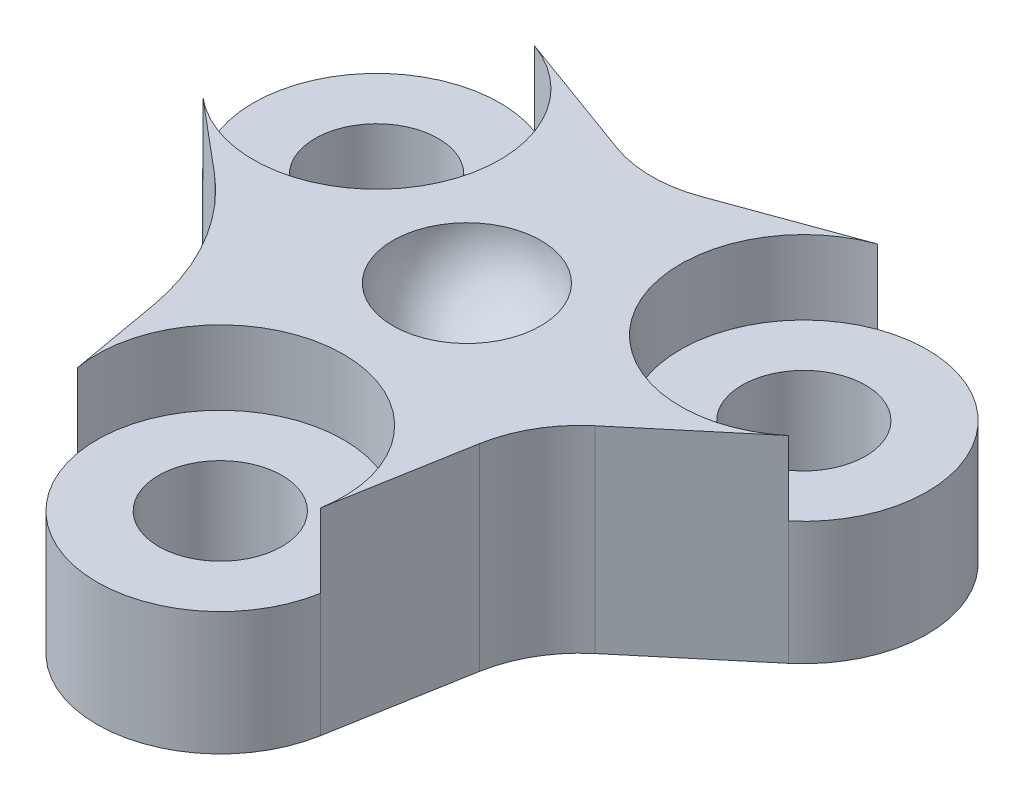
from build123d import *

# Parameters (mm, degrees)
EXTRUDE1_DEPTH     = 8
CUT_EXTRUDE1_START = -3
SKETCH2_R          = 5
CUT_EXTRUDE1_DEPTH = 3
SKETCH3_R          = 2.5
CUT_EXTRUDE2_DEPTH = 21.895036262


with BuildPart() as part:
    # Sketch1 → Extrude1 (new body)
    with BuildSketch(Plane(origin=(0, 0, 0), x_dir=(1, 0, 0), z_dir=(0, 1, 0))):
        with BuildLine():
            Line((-4.924038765, -10.868240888), (-5.576347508, -7.168814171))
            ThreePointArc((-5.576347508, -7.168814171), (-6.764171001, -3.905295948), (-8.996548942, -1.244851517))
            Line((-8.996548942, -1.244851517), (-11.874192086, 1.169777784))
            ThreePointArc((-11.874192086, 1.169777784), (-12.990381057, 7.5), (-6.950153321, 9.698463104))
            Line((-6.950153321, 9.698463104), (-1.710100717, 7.79123993))
            ThreePointArc((-1.710100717, 7.79123993), (0, 7.489703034), (1.710100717, 7.79123993))
            Line((1.710100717, 7.79123993), (6.950153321, 9.698463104))
            ThreePointArc((6.950153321, 9.698463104), (12.990381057, 7.5), (11.874192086, 1.169777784))
            Line((11.874192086, 1.169777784), (7.602462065, -2.414629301))
            ThreePointArc((7.602462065, -2.414629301), (6.486273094, -3.744851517), (5.892361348, -5.376610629))
            Line((5.892361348, -5.376610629), (4.924038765, -10.868240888))
            ThreePointArc((4.924038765, -10.868240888), (0, -15), (-4.924038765, -10.868240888))
        make_face()
    extrude(amount=EXTRUDE1_DEPTH)

    # Sketch2 → Cut-Extrude1 (cut)
    with BuildSketch(Plane(origin=(0, 8, 0), x_dir=(1, 0, 0), z_dir=(0, 1, 0)).offset(CUT_EXTRUDE1_START)):
        with Locations((-8.660254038, 5)):
            Circle(SKETCH2_R)
        with Locations((8.660254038, 5)):
            Circle(SKETCH2_R)
        with Locations((0, -10)):
            Circle(SKETCH2_R)
    extrude(amount=CUT_EXTRUDE1_DEPTH, mode=Mode.SUBTRACT)

    # Sketch3 → Cut-Extrude2 (cut, through all)
    with BuildSketch(Plane(origin=(0, 5, 0), x_dir=(1, 0, 0), z_dir=(0, 1, 0))):
        with Locations(Location((0, -10, 0), (0, 0, 270))):
            Circle(SKETCH3_R)
        with Locations(Location((8.660254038, 5, 0), (0, 0, 270))):
            Circle(SKETCH3_R)
        with Locations(Location((-8.660254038, 5, 0), (0, 0, 270))):
            Circle(SKETCH3_R)
    extrude(amount=-CUT_EXTRUDE2_DEPTH, mode=Mode.SUBTRACT)

    # Sketch6 → Cut-Revolve1 (revolve, cut)
    with BuildSketch(Plane(origin=(0, 8, 0), x_dir=(1, 0, 0), z_dir=(0, 1, 0))):
        with BuildLine():
            Line((0, 3), (0, -3))
            ThreePointArc((0, -3), (3, 0), (0, 3))
        make_face()
    revolve(axis=Axis((0, 8, -9.601919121), (0, 0, 1)), mode=Mode.SUBTRACT)


solid = part.part
